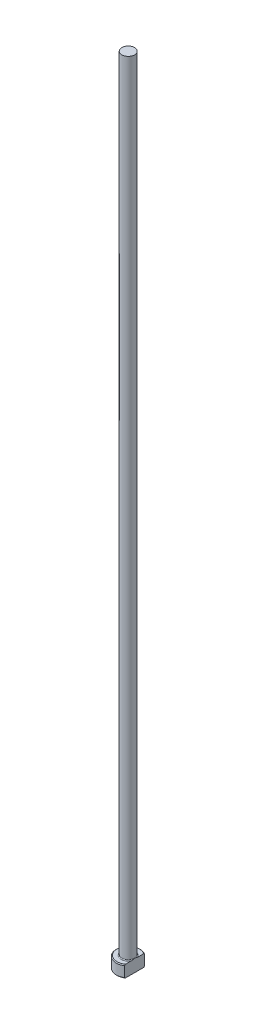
ISO-10303-21;
HEADER;
FILE_DESCRIPTION(('STEP AP214'),'2;1');
FILE_NAME('part.step','',(''),(''),'','','');
FILE_SCHEMA(('AUTOMOTIVE_DESIGN { 1 0 10303 214 1 1 1 1 }'));
ENDSEC;
DATA;
#1=APPLICATION_CONTEXT('core data for automotive mechanical design processes');
#2=APPLICATION_PROTOCOL_DEFINITION('international standard','automotive_design',2000,#1);
#3=PRODUCT_CONTEXT('',#1,'mechanical');
#4=PRODUCT('Part','Part','',(#3));
#5=PRODUCT_RELATED_PRODUCT_CATEGORY('part','',(#4));
#6=PRODUCT_DEFINITION_FORMATION('','',#4);
#7=PRODUCT_DEFINITION_CONTEXT('part definition',#1,'design');
#8=PRODUCT_DEFINITION('design','',#6,#7);
#9=PRODUCT_DEFINITION_SHAPE('','',#8);
#10=(LENGTH_UNIT() NAMED_UNIT(*) SI_UNIT(.MILLI.,.METRE.));
#11=(NAMED_UNIT(*) PLANE_ANGLE_UNIT() SI_UNIT($,.RADIAN.));
#12=(NAMED_UNIT(*) SI_UNIT($,.STERADIAN.) SOLID_ANGLE_UNIT());
#13=UNCERTAINTY_MEASURE_WITH_UNIT(LENGTH_MEASURE(1.E-05),#10,'distance_accuracy_value','');
#14=(GEOMETRIC_REPRESENTATION_CONTEXT(3) GLOBAL_UNCERTAINTY_ASSIGNED_CONTEXT((#13)) GLOBAL_UNIT_ASSIGNED_CONTEXT((#10,
#11,#12)) REPRESENTATION_CONTEXT('',''));
#15=CARTESIAN_POINT('',(0.,0.,0.));
#16=DIRECTION('',(0.,0.,1.));
#17=DIRECTION('',(1.,0.,0.));
#18=AXIS2_PLACEMENT_3D('',#15,#16,#17);
#19=CARTESIAN_POINT('',(0.,0.,0.));
#20=DIRECTION('',(0.,-1.,0.));
#21=DIRECTION('',(0.,0.,-1.));
#22=AXIS2_PLACEMENT_3D('',#19,#20,#21);
#23=PLANE('',#22);
#24=CARTESIAN_POINT('',(0.,0.,0.));
#25=DIRECTION('',(0.,-1.,0.));
#26=DIRECTION('',(0.,0.,-1.));
#27=AXIS2_PLACEMENT_3D('',#24,#25,#26);
#28=CIRCLE('',#27,2.79999999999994);
#29=CARTESIAN_POINT('',(1.59999999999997,0.,2.29782505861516));
#30=VERTEX_POINT('',#29);
#31=CARTESIAN_POINT('',(1.59999999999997,0.,-2.29782505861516));
#32=VERTEX_POINT('',#31);
#33=EDGE_CURVE('E98',#30,#32,#28,.T.);
#34=ORIENTED_EDGE('',*,*,#33,.T.);
#35=DIRECTION('',(0.,0.,1.));
#36=VECTOR('',#35,1.);
#37=CARTESIAN_POINT('',(1.59999999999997,0.,-2.53771550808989));
#38=LINE('',#37,#36);
#39=EDGE_CURVE('E83',#32,#30,#38,.T.);
#40=ORIENTED_EDGE('',*,*,#39,.T.);
#41=EDGE_LOOP('',(#34,#40));
#42=FACE_BOUND('',#41,.T.);
#43=ADVANCED_FACE('F32',(#42),#23,.T.);
#44=CARTESIAN_POINT('',(0.,259.958771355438,0.));
#45=DIRECTION('',(0.,1.,0.));
#46=DIRECTION('',(0.,0.,1.));
#47=AXIS2_PLACEMENT_3D('',#44,#45,#46);
#48=CYLINDRICAL_SURFACE('',#47,2.99999999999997);
#49=CARTESIAN_POINT('',(0.,2.79999999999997,0.));
#50=DIRECTION('',(0.,1.,0.));
#51=DIRECTION('',(0.,0.,1.));
#52=AXIS2_PLACEMENT_3D('',#49,#50,#51);
#53=CIRCLE('',#52,2.99999999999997);
#54=CARTESIAN_POINT('',(1.59999999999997,2.79999999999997,2.53771550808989));
#55=VERTEX_POINT('',#54);
#56=CARTESIAN_POINT('',(1.59999999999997,2.79999999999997,-2.53771550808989));
#57=VERTEX_POINT('',#56);
#58=EDGE_CURVE('E104',#55,#57,#53,.F.);
#59=ORIENTED_EDGE('',*,*,#58,.T.);
#60=DIRECTION('',(0.,-1.,0.));
#61=VECTOR('',#60,1.);
#62=CARTESIAN_POINT('',(1.59999999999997,200.,-2.53771550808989));
#63=LINE('',#62,#61);
#64=CARTESIAN_POINT('',(1.59999999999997,0.200000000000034,-2.53771550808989));
#65=VERTEX_POINT('',#64);
#66=EDGE_CURVE('E183',#57,#65,#63,.T.);
#67=ORIENTED_EDGE('',*,*,#66,.T.);
#68=CARTESIAN_POINT('',(0.,0.200000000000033,0.));
#69=DIRECTION('',(0.,-1.,0.));
#70=DIRECTION('',(0.,0.,-1.));
#71=AXIS2_PLACEMENT_3D('',#68,#69,#70);
#72=CIRCLE('',#71,2.99999999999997);
#73=CARTESIAN_POINT('',(1.59999999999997,0.200000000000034,2.53771550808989));
#74=VERTEX_POINT('',#73);
#75=EDGE_CURVE('E100',#65,#74,#72,.F.);
#76=ORIENTED_EDGE('',*,*,#75,.T.);
#77=DIRECTION('',(0.,-1.,0.));
#78=VECTOR('',#77,1.);
#79=CARTESIAN_POINT('',(1.59999999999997,200.,2.53771550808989));
#80=LINE('',#79,#78);
#81=EDGE_CURVE('E93',#55,#74,#80,.T.);
#82=ORIENTED_EDGE('',*,*,#81,.F.);
#83=EDGE_LOOP('',(#59,#67,#76,#82));
#84=FACE_BOUND('',#83,.T.);
#85=ADVANCED_FACE('F158',(#84),#48,.T.);
#86=CARTESIAN_POINT('',(-2.99999999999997,3.,0.));
#87=DIRECTION('',(0.,1.,0.));
#88=DIRECTION('',(0.,0.,1.));
#89=AXIS2_PLACEMENT_3D('',#86,#87,#88);
#90=PLANE('',#89);
#91=CARTESIAN_POINT('',(0.,3.,0.));
#92=DIRECTION('',(0.,1.,0.));
#93=DIRECTION('',(0.,0.,1.));
#94=AXIS2_PLACEMENT_3D('',#91,#92,#93);
#95=CIRCLE('',#94,2.79999999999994);
#96=CARTESIAN_POINT('',(1.59999999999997,3.,-2.29782505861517));
#97=VERTEX_POINT('',#96);
#98=CARTESIAN_POINT('',(1.59999999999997,3.,2.29782505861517));
#99=VERTEX_POINT('',#98);
#100=EDGE_CURVE('E178',#97,#99,#95,.T.);
#101=ORIENTED_EDGE('',*,*,#100,.T.);
#102=DIRECTION('',(0.,0.,-1.));
#103=VECTOR('',#102,1.);
#104=CARTESIAN_POINT('',(1.59999999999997,3.,0.));
#105=LINE('',#104,#103);
#106=CARTESIAN_POINT('',(1.59999999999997,2.99999999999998,0.824621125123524));
#107=VERTEX_POINT('',#106);
#108=EDGE_CURVE('E57',#99,#107,#105,.T.);
#109=ORIENTED_EDGE('',*,*,#108,.T.);
#110=CARTESIAN_POINT('',(0.,3.,0.));
#111=DIRECTION('',(0.,1.,0.));
#112=DIRECTION('',(0.,0.,1.));
#113=AXIS2_PLACEMENT_3D('',#110,#111,#112);
#114=CIRCLE('',#113,1.79999999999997);
#115=CARTESIAN_POINT('',(1.59999999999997,2.99999999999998,-0.824621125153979));
#116=VERTEX_POINT('',#115);
#117=EDGE_CURVE('E107',#107,#116,#114,.F.);
#118=ORIENTED_EDGE('',*,*,#117,.T.);
#119=EDGE_CURVE('E136',#116,#97,#105,.T.);
#120=ORIENTED_EDGE('',*,*,#119,.T.);
#121=EDGE_LOOP('',(#101,#109,#118,#120));
#122=FACE_BOUND('',#121,.T.);
#123=ADVANCED_FACE('F147',(#122),#90,.T.);
#124=CARTESIAN_POINT('',(0.,3.,0.));
#125=DIRECTION('',(0.,-1.,0.));
#126=DIRECTION('',(0.,0.,-1.));
#127=AXIS2_PLACEMENT_3D('',#124,#125,#126);
#128=CONICAL_SURFACE('',#127,2.79999999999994,0.785398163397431);
#129=ORIENTED_EDGE('',*,*,#58,.F.);
#130=CARTESIAN_POINT('',(1.59999999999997,-0.0101832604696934,5.58553753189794));
#131=CARTESIAN_POINT('',(1.59999999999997,0.0972362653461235,5.47379440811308));
#132=CARTESIAN_POINT('',(1.59999999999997,0.204532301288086,5.36193239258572));
#133=CARTESIAN_POINT('',(1.59999999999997,0.418819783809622,5.13791519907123));
#134=CARTESIAN_POINT('',(1.59999999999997,0.525811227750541,5.02576001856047));
#135=CARTESIAN_POINT('',(1.59999999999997,0.84630386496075,4.6887068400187));
#136=CARTESIAN_POINT('',(1.59999999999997,1.05925853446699,4.46328850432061));
#137=CARTESIAN_POINT('',(1.59999999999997,1.48118306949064,4.01229981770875));
#138=CARTESIAN_POINT('',(1.59999999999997,1.69017139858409,3.78674682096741));
#139=CARTESIAN_POINT('',(1.59999999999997,2.00096196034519,3.44598591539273));
#140=CARTESIAN_POINT('',(1.59999999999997,2.10410381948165,3.33200088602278));
#141=CARTESIAN_POINT('',(1.59999999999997,2.30919104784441,3.10296070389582));
#142=CARTESIAN_POINT('',(1.59999999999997,2.41113644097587,2.98790557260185));
#143=CARTESIAN_POINT('',(1.59999999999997,2.58757545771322,2.78593338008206));
#144=CARTESIAN_POINT('',(1.59999999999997,2.66243160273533,2.69933337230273));
#145=CARTESIAN_POINT('',(1.59999999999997,2.81098408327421,2.5251317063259));
#146=CARTESIAN_POINT('',(1.59999999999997,2.88468033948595,2.43752998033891));
#147=CARTESIAN_POINT('',(1.59999999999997,3.03092909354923,2.26058626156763));
#148=CARTESIAN_POINT('',(1.59999999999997,3.10347340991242,2.17123748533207));
#149=CARTESIAN_POINT('',(1.59999999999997,3.24645363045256,1.99088530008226));
#150=CARTESIAN_POINT('',(1.59999999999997,3.31688989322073,1.89988217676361));
#151=CARTESIAN_POINT('',(1.59999999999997,3.45543929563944,1.71486621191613));
#152=CARTESIAN_POINT('',(1.59999999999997,3.52352676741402,1.62083402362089));
#153=CARTESIAN_POINT('',(1.59999999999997,3.65543930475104,1.42966446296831));
#154=CARTESIAN_POINT('',(1.59999999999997,3.71926060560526,1.33252445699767));
#155=CARTESIAN_POINT('',(1.59999999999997,3.84005824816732,1.13468126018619));
#156=CARTESIAN_POINT('',(1.59999999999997,3.8970666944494,1.03399793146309));
#157=CARTESIAN_POINT('',(1.59999999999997,4.00087857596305,0.827509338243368));
#158=CARTESIAN_POINT('',(1.59999999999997,4.04770238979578,0.721714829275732));
#159=CARTESIAN_POINT('',(1.59999999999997,4.10597629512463,0.55880924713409));
#160=CARTESIAN_POINT('',(1.59999999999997,4.12339902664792,0.503846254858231));
#161=CARTESIAN_POINT('',(1.59999999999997,4.15340775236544,0.392598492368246));
#162=CARTESIAN_POINT('',(1.59999999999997,4.1659945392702,0.336313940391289));
#163=CARTESIAN_POINT('',(1.59999999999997,4.18546795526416,0.223146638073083));
#164=CARTESIAN_POINT('',(1.59999999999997,4.1923931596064,0.166270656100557));
#165=CARTESIAN_POINT('',(1.59999999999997,4.2001645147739,0.0521012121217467));
#166=CARTESIAN_POINT('',(1.59999999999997,4.20101133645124,-0.00519220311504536));
#167=CARTESIAN_POINT('',(1.59999999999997,4.19655603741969,-0.119606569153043));
#168=CARTESIAN_POINT('',(1.59999999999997,4.19124611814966,-0.176727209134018));
#169=CARTESIAN_POINT('',(1.59999999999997,4.17487728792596,-0.290132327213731));
#170=CARTESIAN_POINT('',(1.59999999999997,4.16381718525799,-0.346416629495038));
#171=CARTESIAN_POINT('',(1.59999999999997,4.13658168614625,-0.458175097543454));
#172=CARTESIAN_POINT('',(1.59999999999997,4.12036718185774,-0.513639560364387));
#173=CARTESIAN_POINT('',(1.59999999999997,4.08371568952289,-0.623133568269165));
#174=CARTESIAN_POINT('',(1.59999999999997,4.0632786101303,-0.677163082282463));
#175=CARTESIAN_POINT('',(1.59999999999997,4.01384079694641,-0.796206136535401));
#176=CARTESIAN_POINT('',(1.59999999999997,3.98395404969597,-0.860848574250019));
#177=CARTESIAN_POINT('',(1.59999999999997,3.92024875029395,-0.988182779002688));
#178=CARTESIAN_POINT('',(1.59999999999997,3.88642788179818,-1.0508733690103));
#179=CARTESIAN_POINT('',(1.59999999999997,3.8157506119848,-1.17466308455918));
#180=CARTESIAN_POINT('',(1.59999999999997,3.77888858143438,-1.23575897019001));
#181=CARTESIAN_POINT('',(1.59999999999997,3.7028736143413,-1.35651466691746));
#182=CARTESIAN_POINT('',(1.59999999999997,3.66372022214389,-1.41617418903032));
#183=CARTESIAN_POINT('',(1.59999999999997,3.54280392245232,-1.59458184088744));
#184=CARTESIAN_POINT('',(1.59999999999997,3.45833719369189,-1.71149244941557));
#185=CARTESIAN_POINT('',(1.59999999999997,3.28508486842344,-1.9417731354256));
#186=CARTESIAN_POINT('',(1.59999999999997,3.1963049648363,-2.05514757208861));
#187=CARTESIAN_POINT('',(1.59999999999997,2.98139222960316,-2.3222993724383));
#188=CARTESIAN_POINT('',(1.59999999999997,2.85392433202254,-2.47499901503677));
#189=CARTESIAN_POINT('',(1.59999999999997,2.59557502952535,-2.77749164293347));
#190=CARTESIAN_POINT('',(1.59999999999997,2.46469312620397,-2.92728419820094));
#191=CARTESIAN_POINT('',(1.59999999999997,2.20054459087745,-3.22502658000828));
#192=CARTESIAN_POINT('',(1.59999999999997,2.06727561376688,-3.37297432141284));
#193=CARTESIAN_POINT('',(1.59999999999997,1.7991946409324,-3.66744344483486));
#194=CARTESIAN_POINT('',(1.59999999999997,1.66438274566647,-3.81396491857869));
#195=CARTESIAN_POINT('',(1.59999999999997,1.40205824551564,-4.09689102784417));
#196=CARTESIAN_POINT('',(1.59999999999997,1.27461301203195,-4.2333582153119));
#197=CARTESIAN_POINT('',(1.59999999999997,1.01897493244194,-4.50559511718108));
#198=CARTESIAN_POINT('',(1.59999999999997,0.890782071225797,-4.64136481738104));
#199=CARTESIAN_POINT('',(1.59999999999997,0.634049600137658,-4.91211710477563));
#200=CARTESIAN_POINT('',(1.59999999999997,0.505511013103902,-5.04710066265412));
#201=CARTESIAN_POINT('',(1.59999999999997,0.247978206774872,-5.31662434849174));
#202=CARTESIAN_POINT('',(1.59999999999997,0.118984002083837,-5.45116449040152));
#203=CARTESIAN_POINT('',(1.59999999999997,-0.0101832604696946,-5.58553753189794));
#204=B_SPLINE_CURVE_WITH_KNOTS('',3,(#130,#131,#132,#133,#134,#135,#136,#137,#138,#139,#140,
#141,#142,#143,#144,#145,#146,#147,#148,#149,#150,#151,#152,#153,#154,#155,#156,#157,#158,#159,
#160,#161,#162,#163,#164,#165,#166,#167,#168,#169,#170,#171,#172,#173,#174,#175,#176,#177,#178,
#179,#180,#181,#182,#183,#184,#185,#186,#187,#188,#189,#190,#191,#192,#193,#194,#195,#196,#197,
#198,#199,#200,#201,#202,#203),.UNSPECIFIED.,.F.,.F.,(4,2,2,2,2,2,2,2,2,2,2,2,2,2,2,2,2,2,2,2,2,
2,2,2,2,2,2,2,2,2,2,2,2,2,2,2,4),(0.,0.465004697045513,0.930013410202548,1.86031116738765,
2.78275396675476,3.24391793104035,3.70507266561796,4.0484700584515,4.39189082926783,
4.73714054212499,5.08233118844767,5.43053718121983,5.77904650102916,6.12584271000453,
6.47193849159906,6.64473721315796,6.81750759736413,6.98909076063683,7.16065498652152,
7.33243676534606,7.50425415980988,7.67740760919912,7.85056480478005,8.06403310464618,
8.27762773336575,8.49162700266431,8.70566897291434,9.13816403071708,9.57010297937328,
10.1667391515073,10.7634629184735,11.360809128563,11.9581166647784,12.5182829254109,
13.078460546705,13.6376414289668,14.1968045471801),.UNSPECIFIED.);
#205=EDGE_CURVE('E135',#55,#99,#204,.T.);
#206=ORIENTED_EDGE('',*,*,#205,.T.);
#207=ORIENTED_EDGE('',*,*,#100,.F.);
#208=EDGE_CURVE('E127',#97,#57,#204,.T.);
#209=ORIENTED_EDGE('',*,*,#208,.T.);
#210=EDGE_LOOP('',(#129,#206,#207,#209));
#211=FACE_BOUND('',#210,.T.);
#212=ADVANCED_FACE('F143',(#211),#128,.T.);
#213=CARTESIAN_POINT('',(0.,0.200000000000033,0.));
#214=DIRECTION('',(0.,1.,0.));
#215=DIRECTION('',(0.,0.,1.));
#216=AXIS2_PLACEMENT_3D('',#213,#214,#215);
#217=CONICAL_SURFACE('',#216,2.99999999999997,0.785398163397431);
#218=ORIENTED_EDGE('',*,*,#75,.F.);
#219=CARTESIAN_POINT('',(1.59999999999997,3.0101832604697,-5.58553753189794));
#220=CARTESIAN_POINT('',(1.59999999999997,2.90276373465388,-5.47379440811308));
#221=CARTESIAN_POINT('',(1.59999999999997,2.79546769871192,-5.36193239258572));
#222=CARTESIAN_POINT('',(1.59999999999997,2.58118021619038,-5.13791519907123));
#223=CARTESIAN_POINT('',(1.59999999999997,2.47418877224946,-5.02576001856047));
#224=CARTESIAN_POINT('',(1.59999999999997,2.15369613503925,-4.6887068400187));
#225=CARTESIAN_POINT('',(1.59999999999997,1.94074146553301,-4.46328850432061));
#226=CARTESIAN_POINT('',(1.59999999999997,1.51881693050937,-4.01229981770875));
#227=CARTESIAN_POINT('',(1.59999999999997,1.30982860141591,-3.78674682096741));
#228=CARTESIAN_POINT('',(1.59999999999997,0.999038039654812,-3.44598591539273));
#229=CARTESIAN_POINT('',(1.59999999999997,0.895896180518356,-3.33200088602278));
#230=CARTESIAN_POINT('',(1.59999999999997,0.690808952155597,-3.10296070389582));
#231=CARTESIAN_POINT('',(1.59999999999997,0.588863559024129,-2.98790557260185));
#232=CARTESIAN_POINT('',(1.59999999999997,0.412424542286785,-2.78593338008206));
#233=CARTESIAN_POINT('',(1.59999999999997,0.337568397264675,-2.69933337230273));
#234=CARTESIAN_POINT('',(1.59999999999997,0.189015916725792,-2.5251317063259));
#235=CARTESIAN_POINT('',(1.59999999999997,0.115319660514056,-2.43752998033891));
#236=CARTESIAN_POINT('',(1.59999999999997,-0.0309290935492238,-2.26058626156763));
#237=CARTESIAN_POINT('',(1.59999999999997,-0.103473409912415,-2.17123748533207));
#238=CARTESIAN_POINT('',(1.59999999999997,-0.246453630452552,-1.99088530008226));
#239=CARTESIAN_POINT('',(1.59999999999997,-0.316889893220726,-1.89988217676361));
#240=CARTESIAN_POINT('',(1.59999999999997,-0.455439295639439,-1.71486621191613));
#241=CARTESIAN_POINT('',(1.59999999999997,-0.523526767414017,-1.62083402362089));
#242=CARTESIAN_POINT('',(1.59999999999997,-0.655439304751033,-1.42966446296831));
#243=CARTESIAN_POINT('',(1.59999999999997,-0.719260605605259,-1.33252445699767));
#244=CARTESIAN_POINT('',(1.59999999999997,-0.840058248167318,-1.13468126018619));
#245=CARTESIAN_POINT('',(1.59999999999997,-0.897066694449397,-1.03399793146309));
#246=CARTESIAN_POINT('',(1.59999999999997,-1.00087857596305,-0.827509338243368));
#247=CARTESIAN_POINT('',(1.59999999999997,-1.04770238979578,-0.721714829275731));
#248=CARTESIAN_POINT('',(1.59999999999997,-1.10597629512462,-0.55880924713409));
#249=CARTESIAN_POINT('',(1.59999999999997,-1.12339902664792,-0.503846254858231));
#250=CARTESIAN_POINT('',(1.59999999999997,-1.15340775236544,-0.392598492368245));
#251=CARTESIAN_POINT('',(1.59999999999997,-1.1659945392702,-0.336313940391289));
#252=CARTESIAN_POINT('',(1.59999999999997,-1.18546795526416,-0.223146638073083));
#253=CARTESIAN_POINT('',(1.59999999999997,-1.1923931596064,-0.166270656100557));
#254=CARTESIAN_POINT('',(1.59999999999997,-1.2001645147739,-0.052101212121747));
#255=CARTESIAN_POINT('',(1.59999999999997,-1.20101133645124,0.00519220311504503));
#256=CARTESIAN_POINT('',(1.59999999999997,-1.19655603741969,0.119606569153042));
#257=CARTESIAN_POINT('',(1.59999999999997,-1.19124611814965,0.176727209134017));
#258=CARTESIAN_POINT('',(1.59999999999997,-1.17487728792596,0.290132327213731));
#259=CARTESIAN_POINT('',(1.59999999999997,-1.16381718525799,0.346416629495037));
#260=CARTESIAN_POINT('',(1.59999999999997,-1.13658168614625,0.458175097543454));
#261=CARTESIAN_POINT('',(1.59999999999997,-1.12036718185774,0.513639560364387));
#262=CARTESIAN_POINT('',(1.59999999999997,-1.08371568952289,0.623133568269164));
#263=CARTESIAN_POINT('',(1.59999999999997,-1.0632786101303,0.677163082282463));
#264=CARTESIAN_POINT('',(1.59999999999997,-1.01384079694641,0.7962061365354));
#265=CARTESIAN_POINT('',(1.59999999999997,-0.983954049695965,0.860848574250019));
#266=CARTESIAN_POINT('',(1.59999999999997,-0.920248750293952,0.988182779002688));
#267=CARTESIAN_POINT('',(1.59999999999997,-0.886427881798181,1.0508733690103));
#268=CARTESIAN_POINT('',(1.59999999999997,-0.815750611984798,1.17466308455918));
#269=CARTESIAN_POINT('',(1.59999999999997,-0.77888858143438,1.23575897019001));
#270=CARTESIAN_POINT('',(1.59999999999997,-0.702873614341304,1.35651466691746));
#271=CARTESIAN_POINT('',(1.59999999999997,-0.663720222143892,1.41617418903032));
#272=CARTESIAN_POINT('',(1.59999999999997,-0.542803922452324,1.59458184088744));
#273=CARTESIAN_POINT('',(1.59999999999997,-0.45833719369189,1.71149244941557));
#274=CARTESIAN_POINT('',(1.59999999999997,-0.285084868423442,1.9417731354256));
#275=CARTESIAN_POINT('',(1.59999999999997,-0.196304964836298,2.0551475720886));
#276=CARTESIAN_POINT('',(1.59999999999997,0.0186077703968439,2.3222993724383));
#277=CARTESIAN_POINT('',(1.59999999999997,0.146075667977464,2.47499901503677));
#278=CARTESIAN_POINT('',(1.59999999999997,0.404424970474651,2.77749164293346));
#279=CARTESIAN_POINT('',(1.59999999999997,0.535306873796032,2.92728419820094));
#280=CARTESIAN_POINT('',(1.59999999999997,0.799455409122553,3.22502658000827));
#281=CARTESIAN_POINT('',(1.59999999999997,0.932724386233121,3.37297432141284));
#282=CARTESIAN_POINT('',(1.59999999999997,1.2008053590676,3.66744344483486));
#283=CARTESIAN_POINT('',(1.59999999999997,1.33561725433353,3.81396491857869));
#284=CARTESIAN_POINT('',(1.59999999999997,1.59794175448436,4.09689102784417));
#285=CARTESIAN_POINT('',(1.59999999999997,1.72538698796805,4.23335821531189));
#286=CARTESIAN_POINT('',(1.59999999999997,1.98102506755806,4.50559511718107));
#287=CARTESIAN_POINT('',(1.59999999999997,2.1092179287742,4.64136481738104));
#288=CARTESIAN_POINT('',(1.59999999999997,2.36595039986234,4.91211710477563));
#289=CARTESIAN_POINT('',(1.59999999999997,2.4944889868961,5.04710066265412));
#290=CARTESIAN_POINT('',(1.59999999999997,2.75202179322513,5.31662434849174));
#291=CARTESIAN_POINT('',(1.59999999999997,2.88101599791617,5.45116449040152));
#292=CARTESIAN_POINT('',(1.59999999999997,3.0101832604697,5.58553753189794));
#293=B_SPLINE_CURVE_WITH_KNOTS('',3,(#219,#220,#221,#222,#223,#224,#225,#226,#227,#228,#229,
#230,#231,#232,#233,#234,#235,#236,#237,#238,#239,#240,#241,#242,#243,#244,#245,#246,#247,#248,
#249,#250,#251,#252,#253,#254,#255,#256,#257,#258,#259,#260,#261,#262,#263,#264,#265,#266,#267,
#268,#269,#270,#271,#272,#273,#274,#275,#276,#277,#278,#279,#280,#281,#282,#283,#284,#285,#286,
#287,#288,#289,#290,#291,#292),.UNSPECIFIED.,.F.,.F.,(4,2,2,2,2,2,2,2,2,2,2,2,2,2,2,2,2,2,2,2,2,
2,2,2,2,2,2,2,2,2,2,2,2,2,2,2,4),(0.,0.465004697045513,0.930013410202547,1.86031116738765,
2.78275396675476,3.24391793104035,3.70507266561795,4.0484700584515,4.39189082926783,
4.73714054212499,5.08233118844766,5.43053718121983,5.77904650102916,6.12584271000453,
6.47193849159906,6.64473721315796,6.81750759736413,6.98909076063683,7.16065498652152,
7.33243676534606,7.50425415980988,7.67740760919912,7.85056480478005,8.06403310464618,
8.27762773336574,8.49162700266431,8.70566897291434,9.13816403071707,9.57010297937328,
10.1667391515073,10.7634629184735,11.360809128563,11.9581166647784,12.5182829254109,
13.078460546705,13.6376414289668,14.1968045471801),.UNSPECIFIED.);
#294=EDGE_CURVE('E86',#65,#32,#293,.T.);
#295=ORIENTED_EDGE('',*,*,#294,.T.);
#296=ORIENTED_EDGE('',*,*,#33,.F.);
#297=EDGE_CURVE('E89',#30,#74,#293,.T.);
#298=ORIENTED_EDGE('',*,*,#297,.T.);
#299=EDGE_LOOP('',(#218,#295,#296,#298));
#300=FACE_BOUND('',#299,.T.);
#301=ADVANCED_FACE('F97',(#300),#217,.T.);
#302=CARTESIAN_POINT('',(0.,3.19999999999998,0.));
#303=DIRECTION('',(0.,1.,0.));
#304=DIRECTION('',(0.,0.,1.));
#305=AXIS2_PLACEMENT_3D('',#302,#303,#304);
#306=TOROIDAL_SURFACE('',#305,1.79999999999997,0.2);
#307=CARTESIAN_POINT('',(1.59999999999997,3.19999999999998,0.));
#308=CARTESIAN_POINT('',(1.59999999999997,3.20000050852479,4.54943754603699E-11));
#309=CARTESIAN_POINT('',(1.59999999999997,3.20000101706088,-1.26961255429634E-07));
#310=CARTESIAN_POINT('',(1.59999999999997,3.20000198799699,-5.15663776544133E-07));
#311=CARTESIAN_POINT('',(1.59999999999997,3.20000244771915,-7.82570768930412E-07));
#312=CARTESIAN_POINT('',(1.59999999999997,3.20000337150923,-1.42107859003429E-06));
#313=CARTESIAN_POINT('',(1.59999999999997,3.2000038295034,-1.8013897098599E-06));
#314=CARTESIAN_POINT('',(1.59999999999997,3.20000468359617,-2.61302269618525E-06));
#315=CARTESIAN_POINT('',(1.59999999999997,3.20000508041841,-3.04362154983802E-06));
#316=CARTESIAN_POINT('',(1.59999999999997,3.20000644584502,-4.61783099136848E-06));
#317=CARTESIAN_POINT('',(1.59999999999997,3.2000073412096,-5.82629496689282E-06));
#318=CARTESIAN_POINT('',(1.59999999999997,3.20000890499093,-8.29532278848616E-06));
#319=CARTESIAN_POINT('',(1.59999999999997,3.2000095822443,-9.55059430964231E-06));
#320=CARTESIAN_POINT('',(1.59999999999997,3.2000122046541,-1.4561779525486E-05));
#321=CARTESIAN_POINT('',(1.59999999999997,3.20001402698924,-1.8385925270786E-05));
#322=CARTESIAN_POINT('',(1.59999999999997,3.20001693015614,-2.58398167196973E-05));
#323=CARTESIAN_POINT('',(1.59999999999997,3.20001806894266,-2.9447492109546E-05));
#324=CARTESIAN_POINT('',(1.59999999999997,3.20002303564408,-4.5117550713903E-05));
#325=CARTESIAN_POINT('',(1.59999999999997,3.20002690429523,-5.71577768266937E-05));
#326=CARTESIAN_POINT('',(1.59999999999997,3.20003298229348,-7.95113108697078E-05));
#327=CARTESIAN_POINT('',(1.59999999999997,3.20003536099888,-8.97762976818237E-05));
#328=CARTESIAN_POINT('',(1.59999999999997,3.20005453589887,-0.000165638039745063));
#329=CARTESIAN_POINT('',(1.59999999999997,3.20007944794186,-0.000228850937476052));
#330=CARTESIAN_POINT('',(1.59999999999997,3.20017354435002,-0.000476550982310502));
#331=CARTESIAN_POINT('',(1.59999999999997,3.20023667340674,-0.000662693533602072));
#332=CARTESIAN_POINT('',(1.59999999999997,3.2004875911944,-0.00139193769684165));
#333=CARTESIAN_POINT('',(1.59999999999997,3.20068172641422,-0.00193335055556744));
#334=CARTESIAN_POINT('',(1.59999999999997,3.20147743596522,-0.00416279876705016));
#335=CARTESIAN_POINT('',(1.59999999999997,3.20207183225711,-0.00585269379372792));
#336=CARTESIAN_POINT('',(1.59999999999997,3.2087643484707,-0.0248666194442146));
#337=CARTESIAN_POINT('',(1.59999999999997,3.21490191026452,-0.0421807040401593));
#338=CARTESIAN_POINT('',(1.59999999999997,3.22687857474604,-0.0761752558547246));
#339=CARTESIAN_POINT('',(1.59999999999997,3.23272018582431,-0.092854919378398));
#340=CARTESIAN_POINT('',(1.59999999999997,3.2450295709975,-0.128242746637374));
#341=CARTESIAN_POINT('',(1.59999999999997,3.25148835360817,-0.146954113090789));
#342=CARTESIAN_POINT('',(1.59999999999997,3.26432449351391,-0.18462192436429));
#343=CARTESIAN_POINT('',(1.59999999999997,3.27070030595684,-0.203578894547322));
#344=CARTESIAN_POINT('',(1.59999999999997,3.2861130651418,-0.250227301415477));
#345=CARTESIAN_POINT('',(1.59999999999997,3.29503653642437,-0.277956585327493));
#346=CARTESIAN_POINT('',(1.59999999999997,3.31206503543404,-0.332930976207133));
#347=CARTESIAN_POINT('',(1.59999999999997,3.32018465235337,-0.360171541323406));
#348=CARTESIAN_POINT('',(1.59999999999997,3.33730366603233,-0.420681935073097));
#349=CARTESIAN_POINT('',(1.59999999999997,3.34612355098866,-0.454003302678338));
#350=CARTESIAN_POINT('',(1.59999999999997,3.36232017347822,-0.521270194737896));
#351=CARTESIAN_POINT('',(1.59999999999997,3.36968538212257,-0.555218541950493));
#352=CARTESIAN_POINT('',(1.59999999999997,3.38286655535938,-0.625950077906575));
#353=CARTESIAN_POINT('',(1.59999999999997,3.3885334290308,-0.6627618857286));
#354=CARTESIAN_POINT('',(1.59999999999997,3.3967820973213,-0.736647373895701));
#355=CARTESIAN_POINT('',(1.59999999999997,3.39937308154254,-0.773719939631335));
#356=CARTESIAN_POINT('',(1.59999999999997,3.40041949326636,-0.847207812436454));
#357=CARTESIAN_POINT('',(1.59999999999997,3.39895641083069,-0.88362147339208));
#358=CARTESIAN_POINT('',(1.59999999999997,3.39061157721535,-0.955314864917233));
#359=CARTESIAN_POINT('',(1.59999999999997,3.3838299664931,-0.990603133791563));
#360=CARTESIAN_POINT('',(1.59999999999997,3.36933665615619,-1.03710764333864));
#361=CARTESIAN_POINT('',(1.59999999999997,3.36495855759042,-1.04936206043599));
#362=CARTESIAN_POINT('',(1.59999999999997,3.35498242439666,-1.07342013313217));
#363=CARTESIAN_POINT('',(1.59999999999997,3.34938064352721,-1.08522227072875));
#364=CARTESIAN_POINT('',(1.59999999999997,3.33671785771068,-1.10815425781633));
#365=CARTESIAN_POINT('',(1.59999999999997,3.32964542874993,-1.11927790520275));
#366=CARTESIAN_POINT('',(1.59999999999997,3.31385032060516,-1.14028316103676));
#367=CARTESIAN_POINT('',(1.59999999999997,3.30513251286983,-1.15016829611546));
#368=CARTESIAN_POINT('',(1.59999999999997,3.2893714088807,-1.16476986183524));
#369=CARTESIAN_POINT('',(1.59999999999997,3.28286385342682,-1.17006219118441));
#370=CARTESIAN_POINT('',(1.59999999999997,3.26911414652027,-1.179603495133));
#371=CARTESIAN_POINT('',(1.59999999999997,3.2618722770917,-1.18385286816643));
#372=CARTESIAN_POINT('',(1.59999999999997,3.24665711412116,-1.19105502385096));
#373=CARTESIAN_POINT('',(1.59999999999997,3.23867649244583,-1.19399264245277));
#374=CARTESIAN_POINT('',(1.59999999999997,3.22228884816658,-1.19821047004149));
#375=CARTESIAN_POINT('',(1.59999999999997,3.21388246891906,-1.19949310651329));
#376=CARTESIAN_POINT('',(1.59999999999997,3.19822871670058,-1.20020429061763));
#377=CARTESIAN_POINT('',(1.59999999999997,3.19099166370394,-1.19987658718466));
#378=CARTESIAN_POINT('',(1.59999999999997,3.1766911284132,-1.19794337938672));
#379=CARTESIAN_POINT('',(1.59999999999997,3.16962767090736,-1.19633769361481));
#380=CARTESIAN_POINT('',(1.59999999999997,3.15619326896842,-1.19208069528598));
#381=CARTESIAN_POINT('',(1.59999999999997,3.14980538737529,-1.18948176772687));
#382=CARTESIAN_POINT('',(1.59999999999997,3.13747056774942,-1.18339991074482));
#383=CARTESIAN_POINT('',(1.59999999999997,3.13152374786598,-1.17991674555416));
#384=CARTESIAN_POINT('',(1.59999999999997,3.11701630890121,-1.17013377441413));
#385=CARTESIAN_POINT('',(1.59999999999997,3.10879365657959,-1.16333250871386));
#386=CARTESIAN_POINT('',(1.59999999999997,3.09352344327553,-1.14851362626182));
#387=CARTESIAN_POINT('',(1.59999999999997,3.08647946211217,-1.14049244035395));
#388=CARTESIAN_POINT('',(1.59999999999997,3.06978612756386,-1.11881325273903));
#389=CARTESIAN_POINT('',(1.59999999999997,3.06093454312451,-1.10454463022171));
#390=CARTESIAN_POINT('',(1.59999999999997,3.045486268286,-1.07488732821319));
#391=CARTESIAN_POINT('',(1.59999999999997,3.03889016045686,-1.05949836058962));
#392=CARTESIAN_POINT('',(1.59999999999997,3.02310414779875,-1.01585357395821));
#393=CARTESIAN_POINT('',(1.59999999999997,3.01588276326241,-0.98689334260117));
#394=CARTESIAN_POINT('',(1.59999999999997,3.00554634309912,-0.927965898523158));
#395=CARTESIAN_POINT('',(1.59999999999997,3.00248580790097,-0.89799049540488));
#396=CARTESIAN_POINT('',(1.59999999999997,2.99950013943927,-0.836442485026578));
#397=CARTESIAN_POINT('',(1.59999999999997,2.99973474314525,-0.804863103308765));
#398=CARTESIAN_POINT('',(1.59999999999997,3.00289974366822,-0.74177978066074));
#399=CARTESIAN_POINT('',(1.59999999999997,3.00583724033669,-0.710276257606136));
#400=CARTESIAN_POINT('',(1.59999999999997,3.01360294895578,-0.649223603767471));
#401=CARTESIAN_POINT('',(1.59999999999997,3.01832173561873,-0.61965999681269));
#402=CARTESIAN_POINT('',(1.59999999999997,3.02922114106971,-0.561003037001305));
#403=CARTESIAN_POINT('',(1.59999999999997,3.03539231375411,-0.531907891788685));
#404=CARTESIAN_POINT('',(1.59999999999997,3.05057454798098,-0.466833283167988));
#405=CARTESIAN_POINT('',(1.59999999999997,3.05991050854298,-0.430930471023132));
#406=CARTESIAN_POINT('',(1.59999999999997,3.08015300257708,-0.358646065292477));
#407=CARTESIAN_POINT('',(1.59999999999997,3.09109187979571,-0.322273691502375));
#408=CARTESIAN_POINT('',(1.59999999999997,3.11028869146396,-0.261379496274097));
#409=CARTESIAN_POINT('',(1.59999999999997,3.1182898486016,-0.236775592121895));
#410=CARTESIAN_POINT('',(1.59999999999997,3.13453271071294,-0.18793162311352));
#411=CARTESIAN_POINT('',(1.59999999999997,3.14277104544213,-0.163690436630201));
#412=CARTESIAN_POINT('',(1.59999999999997,3.158545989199,-0.117881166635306));
#413=CARTESIAN_POINT('',(1.59999999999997,3.16606272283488,-0.0963061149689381));
#414=CARTESIAN_POINT('',(1.59999999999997,3.18151152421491,-0.0523381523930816));
#415=CARTESIAN_POINT('',(1.59999999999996,3.18944823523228,-0.0299467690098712));
#416=CARTESIAN_POINT('',(1.59999999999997,3.19792848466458,-0.0058516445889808));
#417=CARTESIAN_POINT('',(1.59999999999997,3.19852328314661,-0.00416072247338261));
#418=CARTESIAN_POINT('',(1.59999999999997,3.19931909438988,-0.00193103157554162));
#419=CARTESIAN_POINT('',(1.59999999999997,3.19951294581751,-0.00139040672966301));
#420=CARTESIAN_POINT('',(1.59999999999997,3.19976352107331,-0.000662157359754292));
#421=CARTESIAN_POINT('',(1.59999999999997,3.19982658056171,-0.000476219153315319));
#422=CARTESIAN_POINT('',(1.59999999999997,3.19992058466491,-0.000228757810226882));
#423=CARTESIAN_POINT('',(1.59999999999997,3.19994548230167,-0.000165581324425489));
#424=CARTESIAN_POINT('',(1.59999999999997,3.19996464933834,-8.97604211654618E-05));
#425=CARTESIAN_POINT('',(1.59999999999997,3.19996702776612,-7.94979693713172E-05));
#426=CARTESIAN_POINT('',(1.59999999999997,3.19997310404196,-5.71501112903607E-05));
#427=CARTESIAN_POINT('',(1.59999999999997,3.19997697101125,-4.51129589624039E-05));
#428=CARTESIAN_POINT('',(1.59999999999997,3.19998193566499,-2.94463390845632E-05));
#429=CARTESIAN_POINT('',(1.59999999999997,3.19998307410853,-2.58390376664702E-05));
#430=CARTESIAN_POINT('',(1.59999999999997,3.1999859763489,-1.83858674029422E-05));
#431=CARTESIAN_POINT('',(1.59999999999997,3.19998779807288,-1.45620535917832E-05));
#432=CARTESIAN_POINT('',(1.59999999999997,3.19999041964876,-9.55118975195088E-06));
#433=CARTESIAN_POINT('',(1.59999999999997,3.19999109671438,-8.29594696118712E-06));
#434=CARTESIAN_POINT('',(1.59999999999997,3.19999266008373,-5.82694057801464E-06));
#435=CARTESIAN_POINT('',(1.59999999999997,3.19999355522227,-4.61846686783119E-06));
#436=CARTESIAN_POINT('',(1.59999999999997,3.19999492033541,-3.04420143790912E-06));
#437=CARTESIAN_POINT('',(1.59999999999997,3.19999531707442,-2.61357770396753E-06));
#438=CARTESIAN_POINT('',(1.59999999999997,3.19999617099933,-1.80187998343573E-06));
#439=CARTESIAN_POINT('',(1.59999999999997,3.19999662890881,-1.4215287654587E-06));
#440=CARTESIAN_POINT('',(1.59999999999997,3.19999755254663,-7.8292447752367E-07));
#441=CARTESIAN_POINT('',(1.59999999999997,3.199998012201,-5.1596356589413E-07));
#442=CARTESIAN_POINT('',(1.59999999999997,3.19999898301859,-1.27129000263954E-07));
#443=CARTESIAN_POINT('',(1.59999999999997,3.19999949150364,-4.54918281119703E-11));
#444=CARTESIAN_POINT('',(1.59999999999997,3.19999999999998,0.));
#445=B_SPLINE_CURVE_WITH_KNOTS('',3,(#307,#308,#309,#310,#311,#312,#313,#314,#315,#316,#317,
#318,#319,#320,#321,#322,#323,#324,#325,#326,#327,#328,#329,#330,#331,#332,#333,#334,#335,#336,
#337,#338,#339,#340,#341,#342,#343,#344,#345,#346,#347,#348,#349,#350,#351,#352,#353,#354,#355,
#356,#357,#358,#359,#360,#361,#362,#363,#364,#365,#366,#367,#368,#369,#370,#371,#372,#373,#374,
#375,#376,#377,#378,#379,#380,#381,#382,#383,#384,#385,#386,#387,#388,#389,#390,#391,#392,#393,
#394,#395,#396,#397,#398,#399,#400,#401,#402,#403,#404,#405,#406,#407,#408,#409,#410,#411,#412,
#413,#414,#415,#416,#417,#418,#419,#420,#421,#422,#423,#424,#425,#426,#427,#428,#429,#430,#431,
#432,#433,#434,#435,#436,#437,#438,#439,#440,#441,#442,#443,#444),.UNSPECIFIED.,.T.,.F.,(4,2,2,
2,2,2,2,2,2,2,2,2,2,2,2,2,2,2,2,2,2,2,2,2,2,2,2,2,2,2,2,2,2,2,2,2,2,2,2,2,2,2,2,2,2,2,2,2,2,2,2,
2,2,2,2,2,2,2,2,2,2,2,2,2,2,2,2,2,4),(0.,1.52634300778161E-06,3.11406916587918E-06,
4.89195151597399E-06,6.64684989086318E-06,1.11381074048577E-05,1.54135914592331E-05,
2.80880177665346E-05,3.94249647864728E-05,7.7360103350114E-05,0.000108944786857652,
0.000312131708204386,0.00090234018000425,0.00262715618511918,0.00800204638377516,
0.0631063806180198,0.116126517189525,0.175509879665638,0.235510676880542,0.322894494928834,
0.408161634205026,0.511541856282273,0.615711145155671,0.727355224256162,0.838664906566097,
0.947753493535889,1.05483601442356,1.09382604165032,1.13293715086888,1.17236425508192,
1.21167640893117,1.23676182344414,1.26183763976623,1.28719627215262,1.31251766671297,
1.33413541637,1.35575623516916,1.37636641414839,1.39698209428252,1.42881268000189,
1.46073825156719,1.51082746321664,1.56092960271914,1.64997182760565,1.74016947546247,
1.83475408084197,1.92958784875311,2.01935385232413,2.10855142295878,2.21980473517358,
2.33373085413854,2.4113451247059,2.48815160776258,2.55669374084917,2.62795640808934,
2.63333459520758,2.63505690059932,2.63564646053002,2.63584953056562,2.63588110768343,
2.6359190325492,2.63593036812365,2.63594304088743,2.63594731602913,2.63595180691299,
2.63595356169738,2.63595533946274,2.63595692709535,2.63595845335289),.UNSPECIFIED.);
#446=CARTESIAN_POINT('',(1.59999999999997,3.19999999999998,0.));
#447=VERTEX_POINT('',#446);
#448=EDGE_CURVE('E11',#116,#447,#445,.T.);
#449=ORIENTED_EDGE('',*,*,#448,.F.);
#450=ORIENTED_EDGE('',*,*,#117,.F.);
#451=CARTESIAN_POINT('',(1.59999999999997,3.19999999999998,0.));
#452=CARTESIAN_POINT('',(1.59999999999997,3.19999949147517,-4.54943940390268E-11));
#453=CARTESIAN_POINT('',(1.59999999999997,3.19999898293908,1.26961255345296E-07));
#454=CARTESIAN_POINT('',(1.59999999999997,3.19999801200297,5.1566377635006E-07));
#455=CARTESIAN_POINT('',(1.59999999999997,3.19999755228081,7.82570768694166E-07));
#456=CARTESIAN_POINT('',(1.59999999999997,3.19999662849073,1.4210785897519E-06));
#457=CARTESIAN_POINT('',(1.59999999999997,3.19999617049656,1.80138970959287E-06));
#458=CARTESIAN_POINT('',(1.59999999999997,3.19999531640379,2.61302269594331E-06));
#459=CARTESIAN_POINT('',(1.59999999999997,3.19999491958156,3.04362154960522E-06));
#460=CARTESIAN_POINT('',(1.59999999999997,3.19999355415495,4.61783099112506E-06));
#461=CARTESIAN_POINT('',(1.59999999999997,3.19999265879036,5.82629496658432E-06));
#462=CARTESIAN_POINT('',(1.59999999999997,3.19999109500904,8.29532278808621E-06));
#463=CARTESIAN_POINT('',(1.59999999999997,3.19999041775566,9.55059430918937E-06));
#464=CARTESIAN_POINT('',(1.59999999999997,3.19998779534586,1.45617795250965E-05));
#465=CARTESIAN_POINT('',(1.59999999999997,3.19998597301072,1.83859252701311E-05));
#466=CARTESIAN_POINT('',(1.59999999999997,3.19998306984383,2.58398167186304E-05));
#467=CARTESIAN_POINT('',(1.59999999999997,3.1999819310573,2.94474921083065E-05));
#468=CARTESIAN_POINT('',(1.59999999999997,3.19997696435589,4.51175507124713E-05));
#469=CARTESIAN_POINT('',(1.59999999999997,3.19997309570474,5.7157776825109E-05));
#470=CARTESIAN_POINT('',(1.59999999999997,3.19996701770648,7.95113108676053E-05));
#471=CARTESIAN_POINT('',(1.59999999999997,3.19996463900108,8.9776297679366E-05));
#472=CARTESIAN_POINT('',(1.59999999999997,3.19994546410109,0.000165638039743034));
#473=CARTESIAN_POINT('',(1.59999999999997,3.1999205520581,0.000228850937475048));
#474=CARTESIAN_POINT('',(1.59999999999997,3.19982645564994,0.000476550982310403));
#475=CARTESIAN_POINT('',(1.59999999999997,3.19976332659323,0.000662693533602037));
#476=CARTESIAN_POINT('',(1.59999999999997,3.19951240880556,0.0013919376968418));
#477=CARTESIAN_POINT('',(1.59999999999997,3.19931827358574,0.0019333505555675));
#478=CARTESIAN_POINT('',(1.59999999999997,3.19852256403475,0.00416279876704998));
#479=CARTESIAN_POINT('',(1.59999999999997,3.19792816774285,0.00585269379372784));
#480=CARTESIAN_POINT('',(1.59999999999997,3.19123565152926,0.0248666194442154));
#481=CARTESIAN_POINT('',(1.59999999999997,3.18509808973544,0.0421807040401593));
#482=CARTESIAN_POINT('',(1.59999999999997,3.17312142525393,0.0761752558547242));
#483=CARTESIAN_POINT('',(1.59999999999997,3.16727981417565,0.0928549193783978));
#484=CARTESIAN_POINT('',(1.59999999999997,3.15497042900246,0.128242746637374));
#485=CARTESIAN_POINT('',(1.59999999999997,3.14851164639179,0.146954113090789));
#486=CARTESIAN_POINT('',(1.59999999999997,3.13567550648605,0.18462192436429));
#487=CARTESIAN_POINT('',(1.59999999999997,3.12929969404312,0.203578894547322));
#488=CARTESIAN_POINT('',(1.59999999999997,3.11388693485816,0.250227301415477));
#489=CARTESIAN_POINT('',(1.59999999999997,3.10496346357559,0.277956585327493));
#490=CARTESIAN_POINT('',(1.59999999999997,3.08793496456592,0.332930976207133));
#491=CARTESIAN_POINT('',(1.59999999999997,3.0798153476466,0.360171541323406));
#492=CARTESIAN_POINT('',(1.59999999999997,3.06269633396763,0.420681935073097));
#493=CARTESIAN_POINT('',(1.59999999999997,3.0538764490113,0.454003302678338));
#494=CARTESIAN_POINT('',(1.59999999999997,3.03767982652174,0.521270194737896));
#495=CARTESIAN_POINT('',(1.59999999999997,3.03031461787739,0.555218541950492));
#496=CARTESIAN_POINT('',(1.59999999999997,3.01713344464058,0.625950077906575));
#497=CARTESIAN_POINT('',(1.59999999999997,3.01146657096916,0.6627618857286));
#498=CARTESIAN_POINT('',(1.59999999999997,3.00321790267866,0.736647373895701));
#499=CARTESIAN_POINT('',(1.59999999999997,3.00062691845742,0.773719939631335));
#500=CARTESIAN_POINT('',(1.59999999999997,2.9995805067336,0.847207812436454));
#501=CARTESIAN_POINT('',(1.59999999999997,3.00104358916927,0.88362147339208));
#502=CARTESIAN_POINT('',(1.59999999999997,3.00938842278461,0.955314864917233));
#503=CARTESIAN_POINT('',(1.59999999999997,3.01617003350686,0.990603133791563));
#504=CARTESIAN_POINT('',(1.59999999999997,3.03066334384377,1.03710764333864));
#505=CARTESIAN_POINT('',(1.59999999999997,3.03504144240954,1.04936206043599));
#506=CARTESIAN_POINT('',(1.59999999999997,3.04501757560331,1.07342013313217));
#507=CARTESIAN_POINT('',(1.59999999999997,3.05061935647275,1.08522227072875));
#508=CARTESIAN_POINT('',(1.59999999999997,3.06328214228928,1.10815425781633));
#509=CARTESIAN_POINT('',(1.59999999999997,3.07035457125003,1.11927790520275));
#510=CARTESIAN_POINT('',(1.59999999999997,3.0861496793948,1.14028316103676));
#511=CARTESIAN_POINT('',(1.59999999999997,3.09486748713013,1.15016829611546));
#512=CARTESIAN_POINT('',(1.59999999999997,3.11062859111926,1.16476986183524));
#513=CARTESIAN_POINT('',(1.59999999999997,3.11713614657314,1.17006219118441));
#514=CARTESIAN_POINT('',(1.59999999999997,3.13088585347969,1.179603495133));
#515=CARTESIAN_POINT('',(1.59999999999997,3.13812772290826,1.18385286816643));
#516=CARTESIAN_POINT('',(1.59999999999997,3.1533428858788,1.19105502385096));
#517=CARTESIAN_POINT('',(1.59999999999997,3.16132350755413,1.19399264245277));
#518=CARTESIAN_POINT('',(1.59999999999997,3.17771115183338,1.19821047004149));
#519=CARTESIAN_POINT('',(1.59999999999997,3.1861175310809,1.19949310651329));
#520=CARTESIAN_POINT('',(1.59999999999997,3.20177128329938,1.20020429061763));
#521=CARTESIAN_POINT('',(1.59999999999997,3.20900833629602,1.19987658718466));
#522=CARTESIAN_POINT('',(1.59999999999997,3.22330887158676,1.19794337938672));
#523=CARTESIAN_POINT('',(1.59999999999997,3.2303723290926,1.19633769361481));
#524=CARTESIAN_POINT('',(1.59999999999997,3.24380673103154,1.19208069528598));
#525=CARTESIAN_POINT('',(1.59999999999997,3.25019461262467,1.18948176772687));
#526=CARTESIAN_POINT('',(1.59999999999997,3.26252943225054,1.18339991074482));
#527=CARTESIAN_POINT('',(1.59999999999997,3.26847625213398,1.17991674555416));
#528=CARTESIAN_POINT('',(1.59999999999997,3.28298369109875,1.17013377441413));
#529=CARTESIAN_POINT('',(1.59999999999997,3.29120634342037,1.16333250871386));
#530=CARTESIAN_POINT('',(1.59999999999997,3.30647655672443,1.14851362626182));
#531=CARTESIAN_POINT('',(1.59999999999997,3.31352053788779,1.14049244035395));
#532=CARTESIAN_POINT('',(1.59999999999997,3.3302138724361,1.11881325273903));
#533=CARTESIAN_POINT('',(1.59999999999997,3.33906545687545,1.10454463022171));
#534=CARTESIAN_POINT('',(1.59999999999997,3.35451373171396,1.07488732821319));
#535=CARTESIAN_POINT('',(1.59999999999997,3.36110983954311,1.05949836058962));
#536=CARTESIAN_POINT('',(1.59999999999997,3.37689585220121,1.01585357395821));
#537=CARTESIAN_POINT('',(1.59999999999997,3.38411723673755,0.98689334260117));
#538=CARTESIAN_POINT('',(1.59999999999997,3.39445365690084,0.927965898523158));
#539=CARTESIAN_POINT('',(1.59999999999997,3.397514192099,0.89799049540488));
#540=CARTESIAN_POINT('',(1.59999999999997,3.40049986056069,0.836442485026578));
#541=CARTESIAN_POINT('',(1.59999999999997,3.40026525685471,0.804863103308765));
#542=CARTESIAN_POINT('',(1.59999999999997,3.39710025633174,0.74177978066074));
#543=CARTESIAN_POINT('',(1.59999999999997,3.39416275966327,0.710276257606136));
#544=CARTESIAN_POINT('',(1.59999999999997,3.38639705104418,0.649223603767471));
#545=CARTESIAN_POINT('',(1.59999999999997,3.38167826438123,0.61965999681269));
#546=CARTESIAN_POINT('',(1.59999999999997,3.37077885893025,0.561003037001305));
#547=CARTESIAN_POINT('',(1.59999999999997,3.36460768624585,0.531907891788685));
#548=CARTESIAN_POINT('',(1.59999999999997,3.34942545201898,0.466833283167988));
#549=CARTESIAN_POINT('',(1.59999999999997,3.34008949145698,0.430930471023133));
#550=CARTESIAN_POINT('',(1.59999999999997,3.31984699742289,0.358646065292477));
#551=CARTESIAN_POINT('',(1.59999999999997,3.30890812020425,0.322273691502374));
#552=CARTESIAN_POINT('',(1.59999999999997,3.289711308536,0.261379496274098));
#553=CARTESIAN_POINT('',(1.59999999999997,3.28171015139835,0.236775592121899));
#554=CARTESIAN_POINT('',(1.59999999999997,3.26546728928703,0.187931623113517));
#555=CARTESIAN_POINT('',(1.59999999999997,3.25722895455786,0.163690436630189));
#556=CARTESIAN_POINT('',(1.59999999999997,3.24145401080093,0.117881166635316));
#557=CARTESIAN_POINT('',(1.59999999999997,3.23393727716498,0.096306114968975));
#558=CARTESIAN_POINT('',(1.59999999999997,3.21848847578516,0.0523381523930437));
#559=CARTESIAN_POINT('',(1.59999999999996,3.21055176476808,0.0299467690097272));
#560=CARTESIAN_POINT('',(1.59999999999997,3.20207151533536,0.00585164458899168));
#561=CARTESIAN_POINT('',(1.59999999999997,3.20147671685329,0.00416072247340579));
#562=CARTESIAN_POINT('',(1.59999999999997,3.2006809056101,0.00193103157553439));
#563=CARTESIAN_POINT('',(1.59999999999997,3.2004870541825,0.0013904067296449));
#564=CARTESIAN_POINT('',(1.59999999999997,3.20023647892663,0.000662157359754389));
#565=CARTESIAN_POINT('',(1.59999999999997,3.2001734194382,0.000476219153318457));
#566=CARTESIAN_POINT('',(1.59999999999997,3.20007941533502,0.000228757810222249));
#567=CARTESIAN_POINT('',(1.59999999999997,3.20005451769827,0.000165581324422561));
#568=CARTESIAN_POINT('',(1.59999999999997,3.20003535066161,8.97604211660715E-05));
#569=CARTESIAN_POINT('',(1.59999999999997,3.20003297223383,7.94979693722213E-05));
#570=CARTESIAN_POINT('',(1.59999999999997,3.20002689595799,5.71501112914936E-05));
#571=CARTESIAN_POINT('',(1.59999999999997,3.20002302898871,4.51129589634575E-05));
#572=CARTESIAN_POINT('',(1.59999999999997,3.20001806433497,2.94463390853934E-05));
#573=CARTESIAN_POINT('',(1.59999999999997,3.20001692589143,2.58390376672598E-05));
#574=CARTESIAN_POINT('',(1.59999999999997,3.20001402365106,1.83858674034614E-05));
#575=CARTESIAN_POINT('',(1.59999999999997,3.20001220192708,1.45620535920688E-05));
#576=CARTESIAN_POINT('',(1.59999999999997,3.2000095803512,9.55118975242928E-06));
#577=CARTESIAN_POINT('',(1.59999999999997,3.20000890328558,8.29594696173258E-06));
#578=CARTESIAN_POINT('',(1.59999999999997,3.20000733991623,5.826940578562E-06));
#579=CARTESIAN_POINT('',(1.59999999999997,3.20000644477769,4.61846686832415E-06));
#580=CARTESIAN_POINT('',(1.59999999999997,3.20000507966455,3.04420143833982E-06));
#581=CARTESIAN_POINT('',(1.59999999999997,3.20000468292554,2.61357770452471E-06));
#582=CARTESIAN_POINT('',(1.59999999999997,3.20000382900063,1.80187998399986E-06));
#583=CARTESIAN_POINT('',(1.59999999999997,3.20000337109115,1.42152876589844E-06));
#584=CARTESIAN_POINT('',(1.59999999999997,3.20000244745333,7.82924477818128E-07));
#585=CARTESIAN_POINT('',(1.59999999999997,3.20000198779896,5.15963566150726E-07));
#586=CARTESIAN_POINT('',(1.59999999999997,3.20000101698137,1.2712900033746E-07));
#587=CARTESIAN_POINT('',(1.59999999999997,3.20000050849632,4.54918467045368E-11));
#588=CARTESIAN_POINT('',(1.59999999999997,3.19999999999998,0.));
#589=B_SPLINE_CURVE_WITH_KNOTS('',3,(#451,#452,#453,#454,#455,#456,#457,#458,#459,#460,#461,
#462,#463,#464,#465,#466,#467,#468,#469,#470,#471,#472,#473,#474,#475,#476,#477,#478,#479,#480,
#481,#482,#483,#484,#485,#486,#487,#488,#489,#490,#491,#492,#493,#494,#495,#496,#497,#498,#499,
#500,#501,#502,#503,#504,#505,#506,#507,#508,#509,#510,#511,#512,#513,#514,#515,#516,#517,#518,
#519,#520,#521,#522,#523,#524,#525,#526,#527,#528,#529,#530,#531,#532,#533,#534,#535,#536,#537,
#538,#539,#540,#541,#542,#543,#544,#545,#546,#547,#548,#549,#550,#551,#552,#553,#554,#555,#556,
#557,#558,#559,#560,#561,#562,#563,#564,#565,#566,#567,#568,#569,#570,#571,#572,#573,#574,#575,
#576,#577,#578,#579,#580,#581,#582,#583,#584,#585,#586,#587,#588),.UNSPECIFIED.,.T.,.F.,(4,2,2,
2,2,2,2,2,2,2,2,2,2,2,2,2,2,2,2,2,2,2,2,2,2,2,2,2,2,2,2,2,2,2,2,2,2,2,2,2,2,2,2,2,2,2,2,2,2,2,2,
2,2,2,2,2,2,2,2,2,2,2,2,2,2,2,2,2,4),(0.,1.52634300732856E-06,3.11406916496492E-06,
4.8919515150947E-06,6.64684988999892E-06,1.1138107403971E-05,1.54135914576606E-05,
2.80880177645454E-05,3.94249647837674E-05,7.73601033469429E-05,0.000108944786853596,
0.000312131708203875,0.000902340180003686,0.00262715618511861,0.0080020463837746,
0.063106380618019,0.116126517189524,0.175509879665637,0.235510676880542,0.322894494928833,
0.408161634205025,0.511541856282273,0.61571114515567,0.727355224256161,0.838664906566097,
0.947753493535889,1.05483601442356,1.09382604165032,1.13293715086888,1.17236425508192,
1.21167640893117,1.23676182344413,1.26183763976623,1.28719627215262,1.31251766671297,
1.33413541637,1.35575623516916,1.37636641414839,1.39698209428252,1.42881268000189,
1.46073825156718,1.51082746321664,1.56092960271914,1.64997182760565,1.74016947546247,
1.83475408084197,1.92958784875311,2.01935385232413,2.10855142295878,2.21980473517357,
2.33373085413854,2.4113451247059,2.48815160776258,2.55669374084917,2.62795640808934,
2.63333459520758,2.63505690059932,2.63564646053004,2.63584953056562,2.63588110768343,
2.6359190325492,2.63593036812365,2.63594304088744,2.63594731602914,2.635951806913,
2.63595356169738,2.63595533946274,2.63595692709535,2.63595845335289),.UNSPECIFIED.);
#590=EDGE_CURVE('E46',#447,#107,#589,.T.);
#591=ORIENTED_EDGE('',*,*,#590,.F.);
#592=CARTESIAN_POINT('',(0.,3.19999999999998,0.));
#593=DIRECTION('',(0.,1.,0.));
#594=DIRECTION('',(0.,0.,1.));
#595=AXIS2_PLACEMENT_3D('',#592,#593,#594);
#596=CIRCLE('',#595,1.59999999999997);
#597=EDGE_CURVE('E103',#447,#447,#596,.T.);
#598=ORIENTED_EDGE('',*,*,#597,.F.);
#599=EDGE_LOOP('',(#449,#450,#591,#598));
#600=FACE_BOUND('',#599,.T.);
#601=ADVANCED_FACE('F34',(#600),#306,.F.);
#602=CARTESIAN_POINT('',(0.,259.958771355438,0.));
#603=DIRECTION('',(0.,1.,0.));
#604=DIRECTION('',(0.,0.,1.));
#605=AXIS2_PLACEMENT_3D('',#602,#603,#604);
#606=CYLINDRICAL_SURFACE('',#605,1.59999999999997);
#607=ORIENTED_EDGE('',*,*,#597,.T.);
#608=EDGE_LOOP('',(#607));
#609=FACE_BOUND('',#608,.T.);
#610=CARTESIAN_POINT('',(0.,200.,0.));
#611=DIRECTION('',(0.,1.,0.));
#612=DIRECTION('',(0.,0.,1.));
#613=AXIS2_PLACEMENT_3D('',#610,#611,#612);
#614=CIRCLE('',#613,1.59999999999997);
#615=CARTESIAN_POINT('',(0.,200.,1.59999999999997));
#616=VERTEX_POINT('',#615);
#617=EDGE_CURVE('E101',#616,#616,#614,.T.);
#618=ORIENTED_EDGE('',*,*,#617,.F.);
#619=EDGE_LOOP('',(#618));
#620=FACE_BOUND('',#619,.T.);
#621=ADVANCED_FACE('F155',(#609,#620),#606,.T.);
#622=CARTESIAN_POINT('',(-1.59999999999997,200.,0.));
#623=DIRECTION('',(0.,1.,0.));
#624=DIRECTION('',(0.,0.,1.));
#625=AXIS2_PLACEMENT_3D('',#622,#623,#624);
#626=PLANE('',#625);
#627=ORIENTED_EDGE('',*,*,#617,.T.);
#628=EDGE_LOOP('',(#627));
#629=FACE_BOUND('',#628,.T.);
#630=ADVANCED_FACE('F121',(#629),#626,.T.);
#631=CARTESIAN_POINT('',(1.59999999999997,200.,-2.53771550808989));
#632=DIRECTION('',(1.,0.,0.));
#633=DIRECTION('',(0.,0.,-1.));
#634=AXIS2_PLACEMENT_3D('',#631,#632,#633);
#635=PLANE('',#634);
#636=ORIENTED_EDGE('',*,*,#66,.F.);
#637=ORIENTED_EDGE('',*,*,#208,.F.);
#638=ORIENTED_EDGE('',*,*,#119,.F.);
#639=ORIENTED_EDGE('',*,*,#448,.T.);
#640=ORIENTED_EDGE('',*,*,#590,.T.);
#641=ORIENTED_EDGE('',*,*,#108,.F.);
#642=ORIENTED_EDGE('',*,*,#205,.F.);
#643=ORIENTED_EDGE('',*,*,#81,.T.);
#644=ORIENTED_EDGE('',*,*,#297,.F.);
#645=ORIENTED_EDGE('',*,*,#39,.F.);
#646=ORIENTED_EDGE('',*,*,#294,.F.);
#647=EDGE_LOOP('',(#636,#637,#638,#639,#640,#641,#642,#643,#644,#645,#646));
#648=FACE_BOUND('',#647,.T.);
#649=ADVANCED_FACE('F85',(#648),#635,.T.);
#650=CLOSED_SHELL('',(#43,#85,#123,#212,#301,#601,#621,#630,#649));
#651=MANIFOLD_SOLID_BREP('B2',#650);
#652=ADVANCED_BREP_SHAPE_REPRESENTATION('',(#18,#651),#14);
#653=SHAPE_DEFINITION_REPRESENTATION(#9,#652);
ENDSEC;
END-ISO-10303-21;
